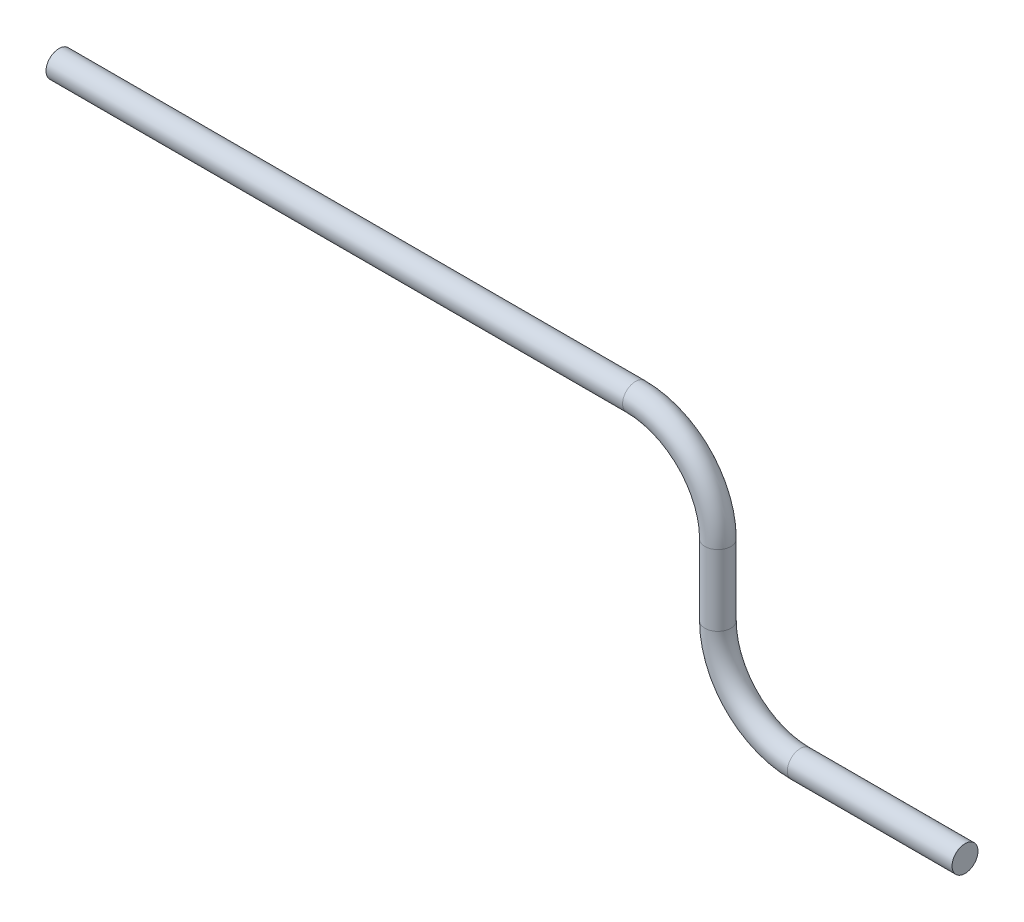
ISO-10303-21;
HEADER;
FILE_DESCRIPTION(('STEP AP214'),'2;1');
FILE_NAME('part.step','',(''),(''),'','','');
FILE_SCHEMA(('AUTOMOTIVE_DESIGN { 1 0 10303 214 1 1 1 1 }'));
ENDSEC;
DATA;
#1=APPLICATION_CONTEXT('core data for automotive mechanical design processes');
#2=APPLICATION_PROTOCOL_DEFINITION('international standard','automotive_design',2000,#1);
#3=PRODUCT_CONTEXT('',#1,'mechanical');
#4=PRODUCT('Part','Part','',(#3));
#5=PRODUCT_RELATED_PRODUCT_CATEGORY('part','',(#4));
#6=PRODUCT_DEFINITION_FORMATION('','',#4);
#7=PRODUCT_DEFINITION_CONTEXT('part definition',#1,'design');
#8=PRODUCT_DEFINITION('design','',#6,#7);
#9=PRODUCT_DEFINITION_SHAPE('','',#8);
#10=(LENGTH_UNIT() NAMED_UNIT(*) SI_UNIT(.MILLI.,.METRE.));
#11=(NAMED_UNIT(*) PLANE_ANGLE_UNIT() SI_UNIT($,.RADIAN.));
#12=(NAMED_UNIT(*) SI_UNIT($,.STERADIAN.) SOLID_ANGLE_UNIT());
#13=UNCERTAINTY_MEASURE_WITH_UNIT(LENGTH_MEASURE(1.E-05),#10,'distance_accuracy_value','');
#14=(GEOMETRIC_REPRESENTATION_CONTEXT(3) GLOBAL_UNCERTAINTY_ASSIGNED_CONTEXT((#13)) GLOBAL_UNIT_ASSIGNED_CONTEXT((#10,
#11,#12)) REPRESENTATION_CONTEXT('',''));
#15=CARTESIAN_POINT('',(0.,0.,0.));
#16=DIRECTION('',(0.,0.,1.));
#17=DIRECTION('',(1.,0.,0.));
#18=AXIS2_PLACEMENT_3D('',#15,#16,#17);
#19=CARTESIAN_POINT('',(10.0000000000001,-12.005259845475,0.));
#20=DIRECTION('',(1.,0.,0.));
#21=DIRECTION('',(0.,0.,-1.));
#22=AXIS2_PLACEMENT_3D('',#19,#20,#21);
#23=CYLINDRICAL_SURFACE('',#22,1.575);
#24=CARTESIAN_POINT('',(10.0000000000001,-12.005259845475,0.));
#25=DIRECTION('',(1.,0.,0.));
#26=DIRECTION('',(0.,0.,-1.));
#27=AXIS2_PLACEMENT_3D('',#24,#25,#26);
#28=CIRCLE('',#27,1.575);
#29=CARTESIAN_POINT('',(10.0000000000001,-13.580259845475,0.));
#30=VERTEX_POINT('',#29);
#31=EDGE_CURVE('E36',#30,#30,#28,.T.);
#32=ORIENTED_EDGE('',*,*,#31,.T.);
#33=EDGE_LOOP('',(#32));
#34=FACE_BOUND('',#33,.T.);
#35=CARTESIAN_POINT('',(30.,-12.005259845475,0.));
#36=DIRECTION('',(1.,0.,0.));
#37=DIRECTION('',(0.,0.,-1.));
#38=AXIS2_PLACEMENT_3D('',#35,#36,#37);
#39=CIRCLE('',#38,1.575);
#40=CARTESIAN_POINT('',(30.,-12.005259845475,-1.575));
#41=VERTEX_POINT('',#40);
#42=EDGE_CURVE('E10',#41,#41,#39,.T.);
#43=ORIENTED_EDGE('',*,*,#42,.F.);
#44=EDGE_LOOP('',(#43));
#45=FACE_BOUND('',#44,.T.);
#46=ADVANCED_FACE('F30',(#34,#45),#23,.T.);
#47=CARTESIAN_POINT('',(10.,-2.00525984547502,0.));
#48=DIRECTION('',(0.,0.,1.));
#49=DIRECTION('',(1.,0.,0.));
#50=AXIS2_PLACEMENT_3D('',#47,#48,#49);
#51=TOROIDAL_SURFACE('',#50,9.99999999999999,1.575);
#52=CARTESIAN_POINT('',(0.,-2.00525984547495,0.));
#53=DIRECTION('',(0.,-1.,0.));
#54=DIRECTION('',(0.,0.,-1.));
#55=AXIS2_PLACEMENT_3D('',#52,#53,#54);
#56=CIRCLE('',#55,1.575);
#57=CARTESIAN_POINT('',(-1.575,-2.00525984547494,0.));
#58=VERTEX_POINT('',#57);
#59=EDGE_CURVE('E40',#58,#58,#56,.T.);
#60=CARTESIAN_POINT('',(10.,-2.00525984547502,0.));
#61=DIRECTION('',(0.,0.,1.));
#62=DIRECTION('',(1.,0.,0.));
#63=AXIS2_PLACEMENT_3D('',#60,#61,#62);
#64=CIRCLE('',#63,11.575);
#65=EDGE_CURVE('',#58,#30,#64,.T.);
#66=ORIENTED_EDGE('',*,*,#59,.T.);
#67=ORIENTED_EDGE('',*,*,#31,.F.);
#68=ORIENTED_EDGE('',*,*,#65,.T.);
#69=ORIENTED_EDGE('',*,*,#65,.F.);
#70=EDGE_LOOP('',(#66,#68,#67,#69));
#71=FACE_BOUND('',#70,.T.);
#72=ADVANCED_FACE('F74',(#71),#51,.T.);
#73=CARTESIAN_POINT('',(0.,6.59153888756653,0.));
#74=DIRECTION('',(0.,-1.,0.));
#75=DIRECTION('',(0.,0.,-1.));
#76=AXIS2_PLACEMENT_3D('',#73,#74,#75);
#77=CYLINDRICAL_SURFACE('',#76,1.575);
#78=CARTESIAN_POINT('',(0.,6.59153888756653,0.));
#79=DIRECTION('',(0.,-1.,0.));
#80=DIRECTION('',(0.,0.,-1.));
#81=AXIS2_PLACEMENT_3D('',#78,#79,#80);
#82=CIRCLE('',#81,1.575);
#83=CARTESIAN_POINT('',(1.575,6.59153888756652,0.));
#84=VERTEX_POINT('',#83);
#85=EDGE_CURVE('E44',#84,#84,#82,.T.);
#86=ORIENTED_EDGE('',*,*,#85,.T.);
#87=EDGE_LOOP('',(#86));
#88=FACE_BOUND('',#87,.T.);
#89=ORIENTED_EDGE('',*,*,#59,.F.);
#90=EDGE_LOOP('',(#89));
#91=FACE_BOUND('',#90,.T.);
#92=ADVANCED_FACE('F78',(#88,#91),#77,.T.);
#93=CARTESIAN_POINT('',(-10.,6.59153888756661,0.));
#94=DIRECTION('',(0.,0.,-1.));
#95=DIRECTION('',(-1.,0.,0.));
#96=AXIS2_PLACEMENT_3D('',#93,#94,#95);
#97=TOROIDAL_SURFACE('',#96,10.,1.575);
#98=CARTESIAN_POINT('',(-10.0000000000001,16.5915388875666,0.));
#99=DIRECTION('',(1.,0.,0.));
#100=DIRECTION('',(0.,0.,-1.));
#101=AXIS2_PLACEMENT_3D('',#98,#99,#100);
#102=CIRCLE('',#101,1.575);
#103=CARTESIAN_POINT('',(-10.0000000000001,18.1665388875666,0.));
#104=VERTEX_POINT('',#103);
#105=EDGE_CURVE('E49',#104,#104,#102,.T.);
#106=CARTESIAN_POINT('',(-10.,6.59153888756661,0.));
#107=DIRECTION('',(0.,0.,-1.));
#108=DIRECTION('',(-1.,0.,0.));
#109=AXIS2_PLACEMENT_3D('',#106,#107,#108);
#110=CIRCLE('',#109,11.575);
#111=EDGE_CURVE('',#104,#84,#110,.T.);
#112=ORIENTED_EDGE('',*,*,#105,.T.);
#113=ORIENTED_EDGE('',*,*,#85,.F.);
#114=ORIENTED_EDGE('',*,*,#111,.T.);
#115=ORIENTED_EDGE('',*,*,#111,.F.);
#116=EDGE_LOOP('',(#112,#114,#113,#115));
#117=FACE_BOUND('',#116,.T.);
#118=ADVANCED_FACE('F56',(#117),#97,.T.);
#119=CARTESIAN_POINT('',(-10.0000000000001,16.5915388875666,0.));
#120=DIRECTION('',(-1.,0.,0.));
#121=DIRECTION('',(0.,0.,1.));
#122=AXIS2_PLACEMENT_3D('',#119,#120,#121);
#123=CYLINDRICAL_SURFACE('',#122,1.575);
#124=ORIENTED_EDGE('',*,*,#105,.F.);
#125=EDGE_LOOP('',(#124));
#126=FACE_BOUND('',#125,.T.);
#127=CARTESIAN_POINT('',(-80.,16.5915388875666,0.));
#128=DIRECTION('',(1.,0.,0.));
#129=DIRECTION('',(0.,0.,-1.));
#130=AXIS2_PLACEMENT_3D('',#127,#128,#129);
#131=CIRCLE('',#130,1.575);
#132=CARTESIAN_POINT('',(-80.,16.5915388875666,-1.575));
#133=VERTEX_POINT('',#132);
#134=EDGE_CURVE('E50',#133,#133,#131,.T.);
#135=ORIENTED_EDGE('',*,*,#134,.T.);
#136=EDGE_LOOP('',(#135));
#137=FACE_BOUND('',#136,.T.);
#138=ADVANCED_FACE('F59',(#126,#137),#123,.T.);
#139=CARTESIAN_POINT('',(30.,-12.005259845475,0.));
#140=DIRECTION('',(1.,0.,0.));
#141=DIRECTION('',(0.,0.,-1.));
#142=AXIS2_PLACEMENT_3D('',#139,#140,#141);
#143=PLANE('',#142);
#144=ORIENTED_EDGE('',*,*,#42,.T.);
#145=EDGE_LOOP('',(#144));
#146=FACE_BOUND('',#145,.T.);
#147=ADVANCED_FACE('F62',(#146),#143,.T.);
#148=CARTESIAN_POINT('',(-80.,16.5915388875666,0.));
#149=DIRECTION('',(1.,0.,0.));
#150=DIRECTION('',(0.,0.,-1.));
#151=AXIS2_PLACEMENT_3D('',#148,#149,#150);
#152=PLANE('',#151);
#153=ORIENTED_EDGE('',*,*,#134,.F.);
#154=EDGE_LOOP('',(#153));
#155=FACE_BOUND('',#154,.T.);
#156=ADVANCED_FACE('F66',(#155),#152,.F.);
#157=CLOSED_SHELL('',(#46,#72,#92,#118,#138,#147,#156));
#158=MANIFOLD_SOLID_BREP('B2',#157);
#159=ADVANCED_BREP_SHAPE_REPRESENTATION('',(#18,#158),#14);
#160=SHAPE_DEFINITION_REPRESENTATION(#9,#159);
ENDSEC;
END-ISO-10303-21;
